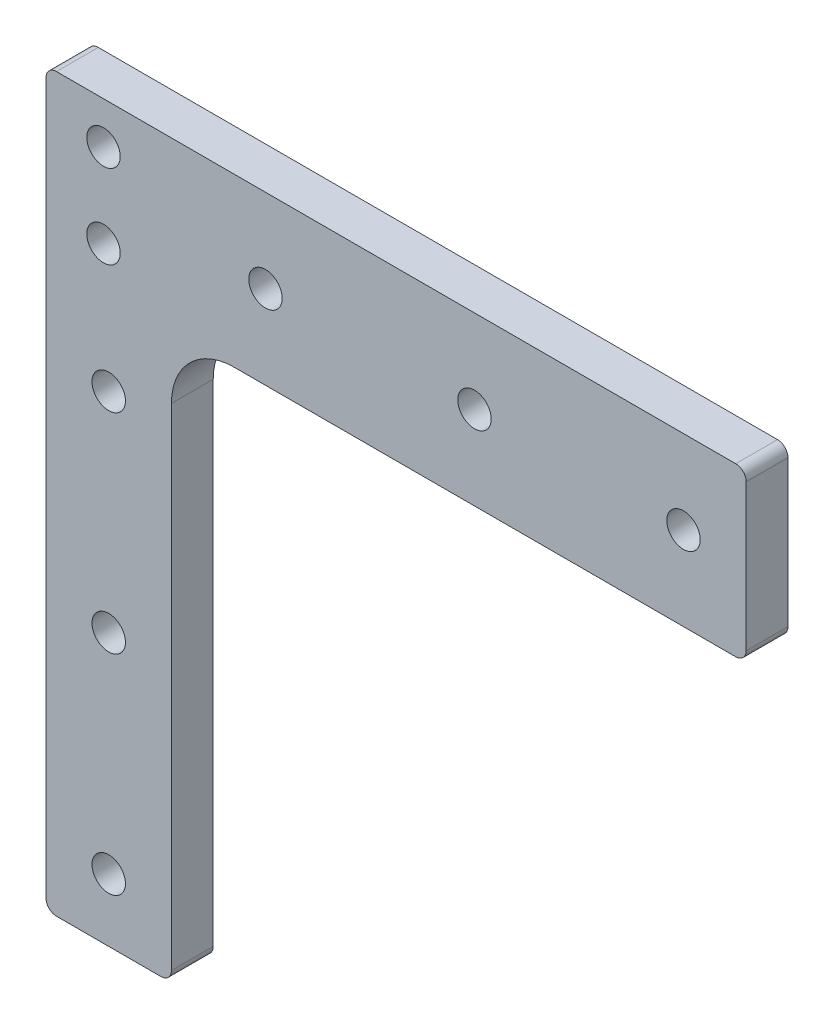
from build123d import *

# Parameters (mm, degrees)
SKETCH_1_R      = 1.6
EXTRUDE_1_DEPTH = 4
FILLET_1_R      = 6
FILLET_2_R      = 1


with BuildPart() as part:
    # Sketch 1 → Extrude 1 (new body)
    with BuildSketch(Plane.XY):
        Polygon((46, 8), (-21, 8), (-21, -62), (-9, -62), (-9, -8), (46, -8), align=None)
        Circle(SKETCH_1_R, mode=Mode.SUBTRACT)
        with Locations((20, 0)):
            Circle(SKETCH_1_R, mode=Mode.SUBTRACT)
        with Locations((40, 0)):
            Circle(SKETCH_1_R, mode=Mode.SUBTRACT)
        with Locations((-15.5, -4)):
            Circle(SKETCH_1_R, mode=Mode.SUBTRACT)
        with Locations((-15.5, 4)):
            Circle(SKETCH_1_R, mode=Mode.SUBTRACT)
        with Locations((-15, -56)):
            Circle(SKETCH_1_R, mode=Mode.SUBTRACT)
        with Locations((-15, -36)):
            Circle(SKETCH_1_R, mode=Mode.SUBTRACT)
        with Locations((-15, -16)):
            Circle(SKETCH_1_R, mode=Mode.SUBTRACT)
    extrude(amount=EXTRUDE_1_DEPTH)

    # Fillet 1
    fillet_1_edges = [part.edges().sort_by_distance(p)[0] for p in [
        (-9, -8, 2),
    ]]
    fillet(fillet_1_edges, radius=FILLET_1_R)

    # Fillet 2
    fillet_2_edges = [part.edges().sort_by_distance(p)[0] for p in [
        (46, -8, 2),
        (-9, -62, 2),
        (-21, -62, 2),
        (-21, 8, 2),
        (46, 8, 2),
    ]]
    fillet(fillet_2_edges, radius=FILLET_2_R)


solid = part.part
